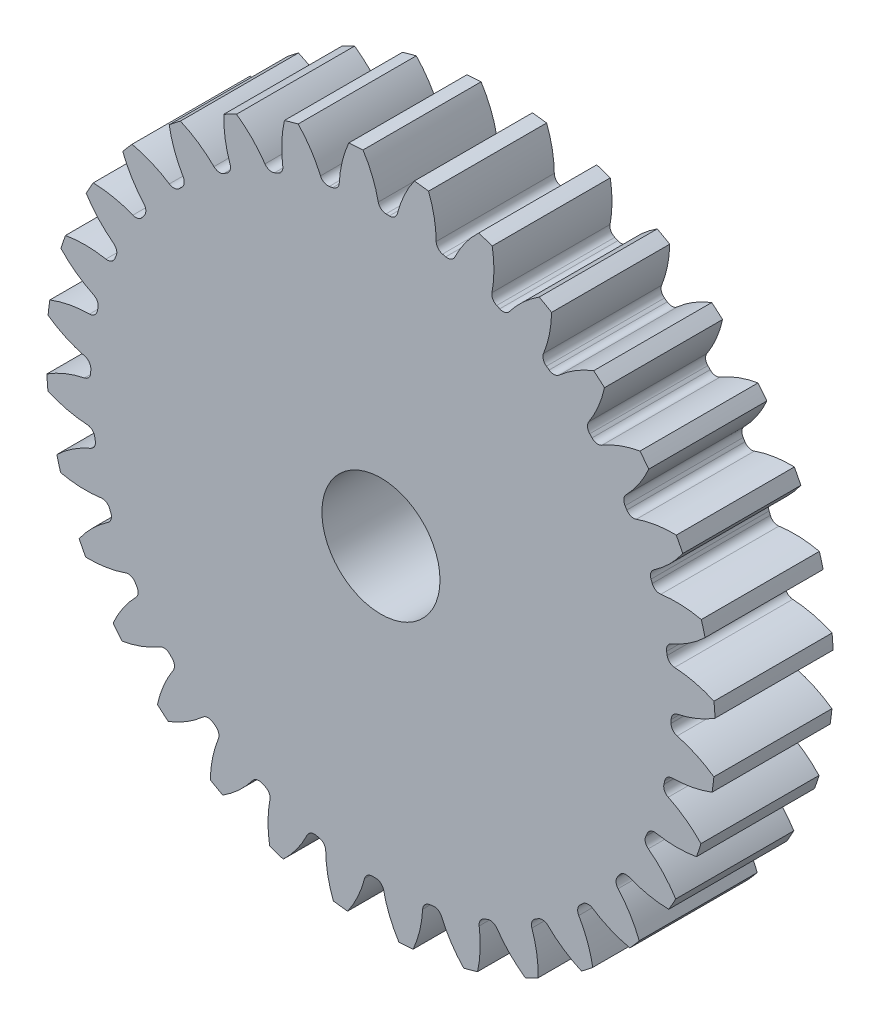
from build123d import *

# Parameters (mm, degrees)
SKETCH3_R         = 287.866666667
GEARBODY_DEPTH    = 101.6
TOOTHCUT_DEPTH    = 420.591462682
CIRPATTERN1_COUNT = 32
BOREDIA_R         = 50.8
BORE_DEPTH        = 12700


with BuildPart() as part:
    # Sketch3 → gearBody (new body)
    with BuildSketch(Plane.XY):
        Circle(SKETCH3_R)
    extrude(amount=GEARBODY_DEPTH)

    # Sketch2 → toothCut (cut, through all)
    with BuildSketch(Plane.XY):
        with BuildLine():
            ThreePointArc((249.662145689, -7.22501126), (249.699889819, -5.77518848), (249.729214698, -4.325170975))
            ThreePointArc((249.729214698, -4.325170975), (251.306929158, -0.054915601), (255.202864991, 2.300068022))
            ThreePointArc((255.202864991, 2.300068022), (272.149143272, 7.513090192), (287.866666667, 15.717443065))
            ThreePointArc((287.866666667, 15.717443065), (288.21835367, -6.666063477), (286.832201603, -29.009376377))
            ThreePointArc((286.832201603, -29.009376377), (271.510790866, -20.087138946), (254.823643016, -14.096225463))
            ThreePointArc((254.823643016, -14.096225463), (251.040749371, -11.563641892), (249.662145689, -7.22501126))
        make_face()
    toothcut = extrude(amount=TOOTHCUT_DEPTH, mode=Mode.SUBTRACT)

    # CirPattern1: toothCut ×32 about axis
    cirpattern1_axis = Axis((0, 0, 0), (0, 0, 1))
    for i in range(1, CIRPATTERN1_COUNT):
        add(toothcut.rotate(cirpattern1_axis, i * 360 / CIRPATTERN1_COUNT), mode=Mode.SUBTRACT)

    # boreDia → bore (cut, symmetric)
    with BuildSketch(Plane.XY):
        Circle(BOREDIA_R)
    extrude(amount=BORE_DEPTH, both=True, mode=Mode.SUBTRACT)


solid = part.part
